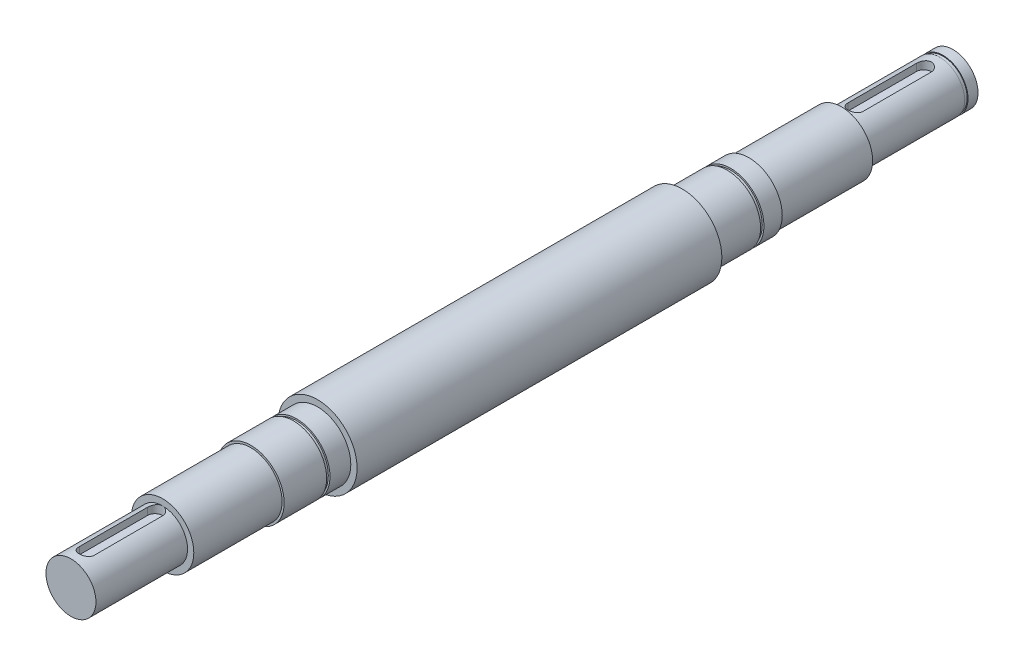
from build123d import *

# Parameters (mm, degrees)
SKETCH2_W          = 4
SKETCH2_H          = 1
SKETCH3_W          = 4
SKETCH3_H          = 2
CUT_EXTRUDE1_DEPTH = 10
CUT_EXTRUDE2_DEPTH = 10


with BuildPart() as part:
    # Sketch1 → Revolve1 (revolve)
    with BuildSketch(Plane(origin=(0, 0, 0), x_dir=(0, 0, -1), z_dir=(1, 0, 0)), mode=Mode.PRIVATE) as revolve1_sk:
        Polygon((529.5, 0), (529.5, 30), (395.5, 30), (395.5, 37.5), (284.5, 37.5), (284.5, 40), (204.5, 40), (204.5, 47.5), (-233.5, 47.5), (-233.5, 40), (-313.5, 40), (-313.5, 37.5), (-419.5, 37.5), (-419.5, 30), (-529.5, 30), (-529.5, 0), align=None)
    revolve(revolve1_sk.sketch.rotate(Axis((0, 0, 529.5), (0, 0, -1)), 90), axis=Axis((0, 0, 529.5), (0, 0, -1)))

    # Sketch2 → Cut-Revolve1 (revolve, cut)
    with BuildSketch(Plane(origin=(0, 0, 0), x_dir=(0, 0, -1), z_dir=(1, 0, 0)), mode=Mode.PRIVATE) as cut_revolve1_sk:
        with Locations((515.5, 29.5)):
            Rectangle(SKETCH2_W, SKETCH2_H)
    revolve(cut_revolve1_sk.sketch.rotate(Axis((0, 0, 0), (0, 0, -1)), 90), axis=Axis((0, 0, 0), (0, 0, -1)), mode=Mode.SUBTRACT)

    # Sketch3 → Cut-Revolve2 (revolve, cut)
    with BuildSketch(Plane(origin=(0, 0, 0), x_dir=(0, 0, -1), z_dir=(1, 0, 0)), mode=Mode.PRIVATE) as cut_revolve2_sk:
        with Locations((260.5, 39)):
            Rectangle(SKETCH3_W, SKETCH3_H)
        with Locations((206.5, 39)):
            Rectangle(SKETCH3_W, SKETCH3_H)
    cut_revolve2 = revolve(cut_revolve2_sk.sketch.rotate(Axis((0, 0, 0), (0, 0, -1)), 90), axis=Axis((0, 0, 0), (0, 0, -1)), mode=Mode.SUBTRACT)

    # Mirror1: Cut-Revolve2 across plane
    add(cut_revolve2.mirror(Plane.XY), mode=Mode.SUBTRACT)

    # Sketch9 → Cut-Extrude1 (cut)
    with BuildSketch(Plane(origin=(0, 30, 0), x_dir=(1, 0, 0), z_dir=(0, 1, 0))):
        with BuildLine():
            Line((9, -428.5), (9, -510.5))
            ThreePointArc((9, -510.5), (0, -519.5), (-9, -510.5))
            Line((-9, -510.5), (-9, -428.5))
            ThreePointArc((-9, -428.5), (0, -419.5), (9, -428.5))
        make_face()
    extrude(amount=-CUT_EXTRUDE1_DEPTH, mode=Mode.SUBTRACT)

    # Sketch10 → Cut-Extrude2 (cut)
    with BuildSketch(Plane(origin=(0, 30, 0), x_dir=(1, 0, 0), z_dir=(0, 1, 0))):
        with BuildLine():
            Line((-9, 412.5), (-9, 494.5))
            ThreePointArc((-9, 494.5), (0, 503.5), (9, 494.5))
            Line((9, 494.5), (9, 412.5))
            ThreePointArc((9, 412.5), (0, 403.5), (-9, 412.5))
        make_face()
    extrude(amount=-CUT_EXTRUDE2_DEPTH, mode=Mode.SUBTRACT)


solid = part.part
